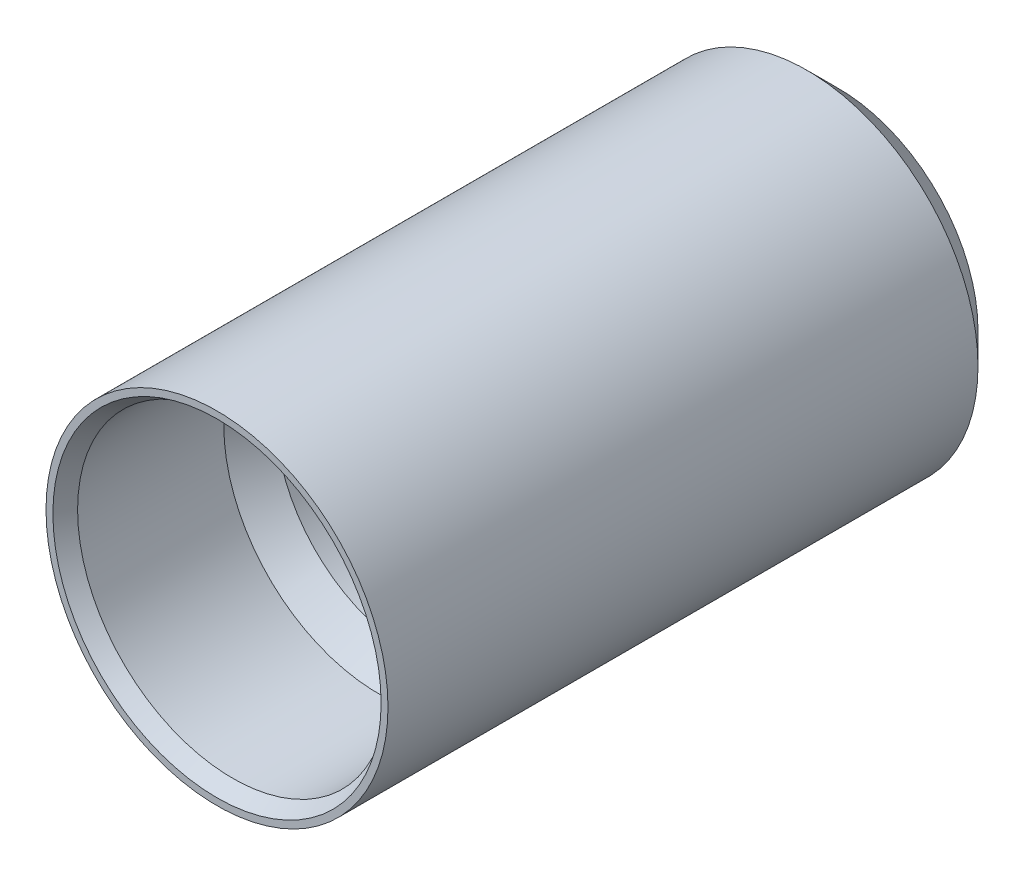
ISO-10303-21;
HEADER;
FILE_DESCRIPTION(('STEP AP214'),'2;1');
FILE_NAME('part.step','',(''),(''),'','','');
FILE_SCHEMA(('AUTOMOTIVE_DESIGN { 1 0 10303 214 1 1 1 1 }'));
ENDSEC;
DATA;
#1=APPLICATION_CONTEXT('core data for automotive mechanical design processes');
#2=APPLICATION_PROTOCOL_DEFINITION('international standard','automotive_design',2000,#1);
#3=PRODUCT_CONTEXT('',#1,'mechanical');
#4=PRODUCT('Part','Part','',(#3));
#5=PRODUCT_RELATED_PRODUCT_CATEGORY('part','',(#4));
#6=PRODUCT_DEFINITION_FORMATION('','',#4);
#7=PRODUCT_DEFINITION_CONTEXT('part definition',#1,'design');
#8=PRODUCT_DEFINITION('design','',#6,#7);
#9=PRODUCT_DEFINITION_SHAPE('','',#8);
#10=(LENGTH_UNIT() NAMED_UNIT(*) SI_UNIT(.MILLI.,.METRE.));
#11=(NAMED_UNIT(*) PLANE_ANGLE_UNIT() SI_UNIT($,.RADIAN.));
#12=(NAMED_UNIT(*) SI_UNIT($,.STERADIAN.) SOLID_ANGLE_UNIT());
#13=UNCERTAINTY_MEASURE_WITH_UNIT(LENGTH_MEASURE(1.E-05),#10,'distance_accuracy_value','');
#14=(GEOMETRIC_REPRESENTATION_CONTEXT(3) GLOBAL_UNCERTAINTY_ASSIGNED_CONTEXT((#13)) GLOBAL_UNIT_ASSIGNED_CONTEXT((#10,
#11,#12)) REPRESENTATION_CONTEXT('',''));
#15=CARTESIAN_POINT('',(0.,0.,0.));
#16=DIRECTION('',(0.,0.,1.));
#17=DIRECTION('',(1.,0.,0.));
#18=AXIS2_PLACEMENT_3D('',#15,#16,#17);
#19=CARTESIAN_POINT('',(0.,15.967481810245,0.));
#20=DIRECTION('',(0.,0.,-1.));
#21=DIRECTION('',(-1.,0.,0.));
#22=AXIS2_PLACEMENT_3D('',#19,#20,#21);
#23=PLANE('',#22);
#24=CARTESIAN_POINT('',(0.,0.,0.));
#25=DIRECTION('',(0.,0.,1.));
#26=DIRECTION('',(1.,0.,0.));
#27=AXIS2_PLACEMENT_3D('',#24,#25,#26);
#28=CIRCLE('',#27,15.967481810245);
#29=CARTESIAN_POINT('',(15.967481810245,0.,0.));
#30=VERTEX_POINT('',#29);
#31=EDGE_CURVE('E11',#30,#30,#28,.T.);
#32=ORIENTED_EDGE('',*,*,#31,.F.);
#33=EDGE_LOOP('',(#32));
#34=FACE_BOUND('',#33,.T.);
#35=CARTESIAN_POINT('',(0.,0.,0.));
#36=DIRECTION('',(0.,0.,1.));
#37=DIRECTION('',(1.,0.,0.));
#38=AXIS2_PLACEMENT_3D('',#35,#36,#37);
#39=CIRCLE('',#38,16.637);
#40=CARTESIAN_POINT('',(16.637,0.,0.));
#41=VERTEX_POINT('',#40);
#42=EDGE_CURVE('E81',#41,#41,#39,.T.);
#43=ORIENTED_EDGE('',*,*,#42,.T.);
#44=EDGE_LOOP('',(#43));
#45=FACE_BOUND('',#44,.T.);
#46=ADVANCED_FACE('F30',(#34,#45),#23,.F.);
#47=CARTESIAN_POINT('',(0.,0.,0.));
#48=DIRECTION('',(0.,0.,1.));
#49=DIRECTION('',(1.,0.,0.));
#50=AXIS2_PLACEMENT_3D('',#47,#48,#49);
#51=CONICAL_SURFACE('',#50,15.967481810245,0.5235987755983);
#52=CARTESIAN_POINT('',(0.,0.,-1.52400000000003));
#53=DIRECTION('',(0.,0.,1.));
#54=DIRECTION('',(1.,0.,0.));
#55=AXIS2_PLACEMENT_3D('',#52,#53,#54);
#56=CIRCLE('',#55,15.0876);
#57=CARTESIAN_POINT('',(15.0876,0.,-1.52400000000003));
#58=VERTEX_POINT('',#57);
#59=EDGE_CURVE('E36',#58,#58,#56,.T.);
#60=ORIENTED_EDGE('',*,*,#59,.F.);
#61=EDGE_LOOP('',(#60));
#62=FACE_BOUND('',#61,.T.);
#63=ORIENTED_EDGE('',*,*,#31,.T.);
#64=EDGE_LOOP('',(#63));
#65=FACE_BOUND('',#64,.T.);
#66=ADVANCED_FACE('F72',(#62,#65),#51,.F.);
#67=CARTESIAN_POINT('',(0.,0.,7.99629629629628));
#68=DIRECTION('',(0.,0.,1.));
#69=DIRECTION('',(1.,0.,0.));
#70=AXIS2_PLACEMENT_3D('',#67,#68,#69);
#71=CYLINDRICAL_SURFACE('',#70,15.0876);
#72=CARTESIAN_POINT('',(0.,0.,-15.748));
#73=DIRECTION('',(0.,0.,1.));
#74=DIRECTION('',(1.,0.,0.));
#75=AXIS2_PLACEMENT_3D('',#72,#73,#74);
#76=CIRCLE('',#75,15.0876);
#77=CARTESIAN_POINT('',(15.0876,0.,-15.748));
#78=VERTEX_POINT('',#77);
#79=EDGE_CURVE('E65',#78,#78,#76,.T.);
#80=ORIENTED_EDGE('',*,*,#79,.F.);
#81=EDGE_LOOP('',(#80));
#82=FACE_BOUND('',#81,.T.);
#83=ORIENTED_EDGE('',*,*,#59,.T.);
#84=EDGE_LOOP('',(#83));
#85=FACE_BOUND('',#84,.T.);
#86=ADVANCED_FACE('F70',(#82,#85),#71,.F.);
#87=CARTESIAN_POINT('',(0.,0.,-15.748));
#88=DIRECTION('',(0.,0.,1.));
#89=DIRECTION('',(1.,0.,0.));
#90=AXIS2_PLACEMENT_3D('',#87,#88,#89);
#91=CONICAL_SURFACE('',#90,15.0876,0.523598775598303);
#92=CARTESIAN_POINT('',(0.,0.,-18.9683674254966));
#93=DIRECTION('',(0.,0.,1.));
#94=DIRECTION('',(1.,0.,0.));
#95=AXIS2_PLACEMENT_3D('',#92,#93,#94);
#96=CIRCLE('',#95,13.22832);
#97=CARTESIAN_POINT('',(13.22832,0.,-18.9683674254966));
#98=VERTEX_POINT('',#97);
#99=EDGE_CURVE('E62',#98,#98,#96,.T.);
#100=ORIENTED_EDGE('',*,*,#99,.F.);
#101=EDGE_LOOP('',(#100));
#102=FACE_BOUND('',#101,.T.);
#103=ORIENTED_EDGE('',*,*,#79,.T.);
#104=EDGE_LOOP('',(#103));
#105=FACE_BOUND('',#104,.T.);
#106=ADVANCED_FACE('F110',(#102,#105),#91,.F.);
#107=CARTESIAN_POINT('',(0.,0.,7.99629629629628));
#108=DIRECTION('',(0.,0.,1.));
#109=DIRECTION('',(1.,0.,0.));
#110=AXIS2_PLACEMENT_3D('',#107,#108,#109);
#111=CYLINDRICAL_SURFACE('',#110,13.22832);
#112=CARTESIAN_POINT('',(0.,0.,-35.052));
#113=DIRECTION('',(0.,0.,1.));
#114=DIRECTION('',(1.,0.,0.));
#115=AXIS2_PLACEMENT_3D('',#112,#113,#114);
#116=CIRCLE('',#115,13.22832);
#117=CARTESIAN_POINT('',(13.22832,0.,-35.052));
#118=VERTEX_POINT('',#117);
#119=EDGE_CURVE('E53',#118,#118,#116,.T.);
#120=ORIENTED_EDGE('',*,*,#119,.F.);
#121=EDGE_LOOP('',(#120));
#122=FACE_BOUND('',#121,.T.);
#123=ORIENTED_EDGE('',*,*,#99,.T.);
#124=EDGE_LOOP('',(#123));
#125=FACE_BOUND('',#124,.T.);
#126=ADVANCED_FACE('F106',(#122,#125),#111,.F.);
#127=CARTESIAN_POINT('',(0.,0.,-35.052));
#128=DIRECTION('',(0.,0.,1.));
#129=DIRECTION('',(1.,0.,0.));
#130=AXIS2_PLACEMENT_3D('',#127,#128,#129);
#131=CONICAL_SURFACE('',#130,13.22832,0.785398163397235);
#132=CARTESIAN_POINT('',(0.,0.,-35.07232));
#133=DIRECTION('',(0.,0.,1.));
#134=DIRECTION('',(1.,0.,0.));
#135=AXIS2_PLACEMENT_3D('',#132,#133,#134);
#136=CIRCLE('',#135,13.208);
#137=CARTESIAN_POINT('',(13.208,0.,-35.07232));
#138=VERTEX_POINT('',#137);
#139=EDGE_CURVE('E49',#138,#138,#136,.T.);
#140=ORIENTED_EDGE('',*,*,#139,.F.);
#141=EDGE_LOOP('',(#140));
#142=FACE_BOUND('',#141,.T.);
#143=ORIENTED_EDGE('',*,*,#119,.T.);
#144=EDGE_LOOP('',(#143));
#145=FACE_BOUND('',#144,.T.);
#146=ADVANCED_FACE('F103',(#142,#145),#131,.F.);
#147=CARTESIAN_POINT('',(0.,0.,7.99629629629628));
#148=DIRECTION('',(0.,0.,1.));
#149=DIRECTION('',(1.,0.,0.));
#150=AXIS2_PLACEMENT_3D('',#147,#148,#149);
#151=CYLINDRICAL_SURFACE('',#150,13.208);
#152=CARTESIAN_POINT('',(0.,0.,-47.752));
#153=DIRECTION('',(0.,0.,1.));
#154=DIRECTION('',(1.,0.,0.));
#155=AXIS2_PLACEMENT_3D('',#152,#153,#154);
#156=CIRCLE('',#155,13.208);
#157=CARTESIAN_POINT('',(13.208,0.,-47.752));
#158=VERTEX_POINT('',#157);
#159=EDGE_CURVE('E47',#158,#158,#156,.T.);
#160=ORIENTED_EDGE('',*,*,#159,.F.);
#161=EDGE_LOOP('',(#160));
#162=FACE_BOUND('',#161,.T.);
#163=ORIENTED_EDGE('',*,*,#139,.T.);
#164=EDGE_LOOP('',(#163));
#165=FACE_BOUND('',#164,.T.);
#166=ADVANCED_FACE('F43',(#162,#165),#151,.F.);
#167=CARTESIAN_POINT('',(0.,0.,-47.752));
#168=DIRECTION('',(0.,0.,1.));
#169=DIRECTION('',(1.,0.,0.));
#170=AXIS2_PLACEMENT_3D('',#167,#168,#169);
#171=CONICAL_SURFACE('',#170,13.208,1.02974425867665);
#172=CARTESIAN_POINT('',(0.,0.,-55.6881670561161));
#173=VERTEX_POINT('',#172);
#174=VERTEX_LOOP('',#173);
#175=FACE_BOUND('',#174,.T.);
#176=ORIENTED_EDGE('',*,*,#159,.T.);
#177=EDGE_LOOP('',(#176));
#178=FACE_BOUND('',#177,.T.);
#179=ADVANCED_FACE('F39',(#175,#178),#171,.F.);
#180=CARTESIAN_POINT('',(0.,13.589,-60.452));
#181=DIRECTION('',(0.,0.,1.));
#182=DIRECTION('',(1.,0.,0.));
#183=AXIS2_PLACEMENT_3D('',#180,#181,#182);
#184=PLANE('',#183);
#185=CARTESIAN_POINT('',(0.,0.,-60.452));
#186=DIRECTION('',(0.,0.,1.));
#187=DIRECTION('',(1.,0.,0.));
#188=AXIS2_PLACEMENT_3D('',#185,#186,#187);
#189=CIRCLE('',#188,13.589);
#190=CARTESIAN_POINT('',(13.589,0.,-60.452));
#191=VERTEX_POINT('',#190);
#192=EDGE_CURVE('E50',#191,#191,#189,.T.);
#193=ORIENTED_EDGE('',*,*,#192,.F.);
#194=EDGE_LOOP('',(#193));
#195=FACE_BOUND('',#194,.T.);
#196=ADVANCED_FACE('F42',(#195),#184,.F.);
#197=CARTESIAN_POINT('',(0.,0.,-60.452));
#198=DIRECTION('',(0.,0.,1.));
#199=DIRECTION('',(1.,0.,0.));
#200=AXIS2_PLACEMENT_3D('',#197,#198,#199);
#201=CONICAL_SURFACE('',#200,13.589,0.785398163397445);
#202=CARTESIAN_POINT('',(0.,0.,-57.404));
#203=DIRECTION('',(0.,0.,1.));
#204=DIRECTION('',(1.,0.,0.));
#205=AXIS2_PLACEMENT_3D('',#202,#203,#204);
#206=CIRCLE('',#205,16.637);
#207=CARTESIAN_POINT('',(16.637,0.,-57.404));
#208=VERTEX_POINT('',#207);
#209=EDGE_CURVE('E56',#208,#208,#206,.T.);
#210=ORIENTED_EDGE('',*,*,#209,.F.);
#211=EDGE_LOOP('',(#210));
#212=FACE_BOUND('',#211,.T.);
#213=ORIENTED_EDGE('',*,*,#192,.T.);
#214=EDGE_LOOP('',(#213));
#215=FACE_BOUND('',#214,.T.);
#216=ADVANCED_FACE('F89',(#212,#215),#201,.T.);
#217=CARTESIAN_POINT('',(0.,0.,7.99629629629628));
#218=DIRECTION('',(0.,0.,1.));
#219=DIRECTION('',(1.,0.,0.));
#220=AXIS2_PLACEMENT_3D('',#217,#218,#219);
#221=CYLINDRICAL_SURFACE('',#220,16.637);
#222=ORIENTED_EDGE('',*,*,#42,.F.);
#223=EDGE_LOOP('',(#222));
#224=FACE_BOUND('',#223,.T.);
#225=ORIENTED_EDGE('',*,*,#209,.T.);
#226=EDGE_LOOP('',(#225));
#227=FACE_BOUND('',#226,.T.);
#228=ADVANCED_FACE('F87',(#224,#227),#221,.T.);
#229=CLOSED_SHELL('',(#46,#66,#86,#106,#126,#146,#166,#179,#196,#216,#228));
#230=MANIFOLD_SOLID_BREP('B2',#229);
#231=ADVANCED_BREP_SHAPE_REPRESENTATION('',(#18,#230),#14);
#232=SHAPE_DEFINITION_REPRESENTATION(#9,#231);
ENDSEC;
END-ISO-10303-21;
